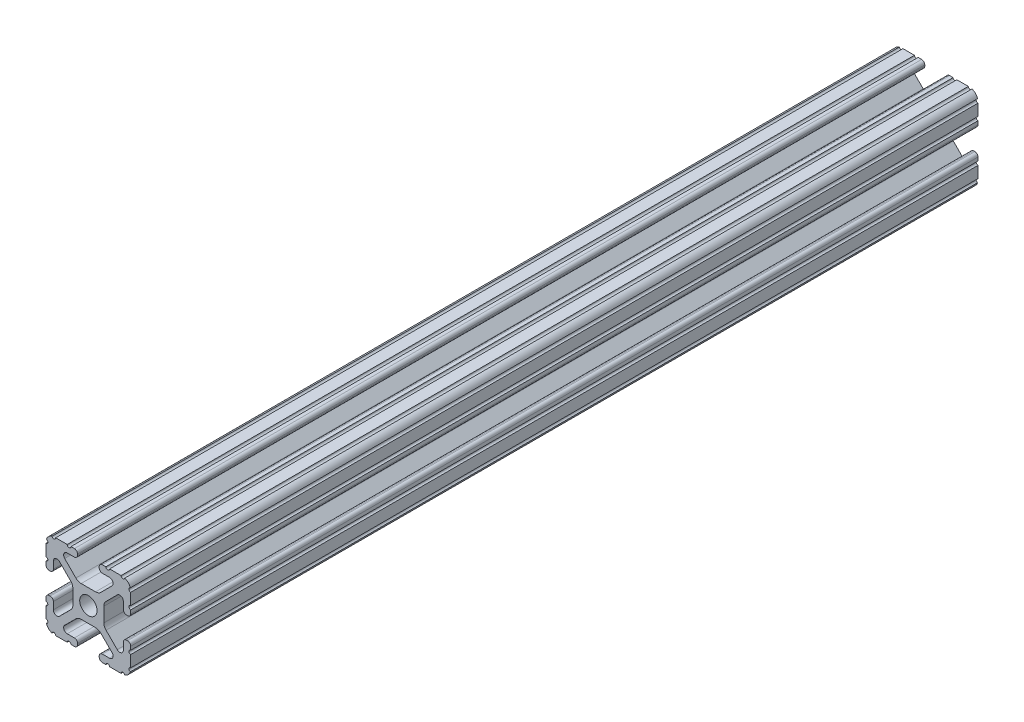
from build123d import *

# Parameters (mm, degrees)
BOSS_EXTRUDE1_DEPTH     = 127
CUT_EXTRUDE1_DEPTH      = 129.263712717
CUT_EXTRUDE1_DEPTH_BACK = 129.263712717
SKETCH5_R               = 0.55245


with BuildPart() as part:
    # Sketch4 → Boss-Extrude1 (new, symmetric)
    with BuildSketch(Plane.XY):
        with BuildLine():
            Line((4.190365, -12.7), (10.11729625, -12.7))
            ThreePointArc((10.11729625, -12.7), (11.943543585, -11.943543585), (12.7, -10.11729625))
            Line((12.7, -10.11729625), (12.7, -4.190365))
            ThreePointArc((12.7, -4.190365), (12.42492494, -3.52627506), (11.760835, -3.2512))
            Line((11.760835, -3.2512), (11.429365, -3.2512))
            ThreePointArc((11.429365, -3.2512), (10.76527506, -3.52627506), (10.4902, -4.190365))
            Line((10.4902, -4.190365), (10.4902, -6.348478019))
            ThreePointArc((10.4902, -6.348478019), (9.830707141, -7.335478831), (8.666460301, -7.103895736))
            Line((8.666460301, -7.103895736), (5.299899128, -3.737334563))
            ThreePointArc((5.299899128, -3.737334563), (4.817571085, -3.015479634), (4.6482, -2.16399369))
            Line((4.6482, -2.16399369), (4.6482, 0))
            Line((4.6482, 0), (2.6035, 0))
            ThreePointArc((2.6035, 0), (1.840952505, -1.840952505), (0, -2.6035))
            Line((0, -2.6035), (0, -4.6482))
            Line((0, -4.6482), (2.16399369, -4.6482))
            ThreePointArc((2.16399369, -4.6482), (3.015479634, -4.817571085), (3.737334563, -5.299899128))
            Line((3.737334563, -5.299899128), (7.103895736, -8.666460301))
            ThreePointArc((7.103895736, -8.666460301), (7.335478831, -9.830707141), (6.348478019, -10.4902))
            Line((6.348478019, -10.4902), (4.190365, -10.4902))
            ThreePointArc((4.190365, -10.4902), (3.52627506, -10.76527506), (3.2512, -11.429365))
            Line((3.2512, -11.429365), (3.2512, -11.760835))
            ThreePointArc((3.2512, -11.760835), (3.52627506, -12.42492494), (4.190365, -12.7))
        make_face()
    extrude(amount=BOSS_EXTRUDE1_DEPTH, both=True)

    # Sketch5 → Cut-Extrude1 (cut, two sides: drawn at the far end of the back side and taken through both)
    with BuildSketch(Plane.XY.offset(-CUT_EXTRUDE1_DEPTH_BACK)):
        with Locations((10.356153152, -12.7)):
            Circle(SKETCH5_R)
        with Locations((5.796028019, -12.7)):
            Circle(SKETCH5_R)
        with Locations((12.7, -10.356153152)):
            Circle(SKETCH5_R)
        with Locations((12.7, -5.796028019)):
            Circle(SKETCH5_R)
    extrude(amount=CUT_EXTRUDE1_DEPTH + CUT_EXTRUDE1_DEPTH_BACK, mode=Mode.SUBTRACT)

    # Mirror1: part across plane


with BuildPart() as part_1:
    add(part.part)
    add(part.part.mirror(Plane(origin=(0, 0, 0), x_dir=(0, 0, 1), z_dir=(1, 0, 0))))

    # Mirror2: part across plane


with BuildPart() as part_2:
    add(part_1.part)
    add(part_1.part.mirror(Plane.ZX))


solid = part_2.part
